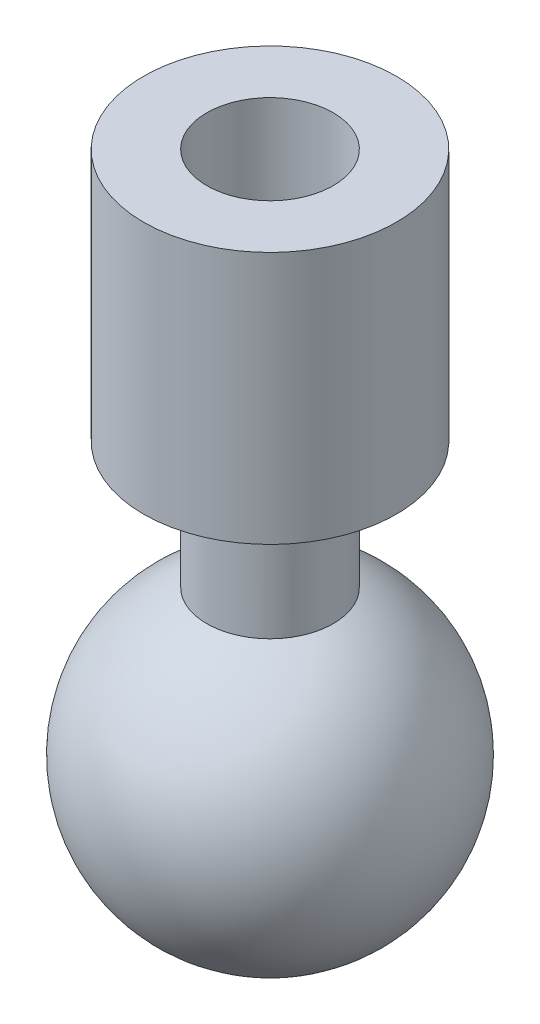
ISO-10303-21;
HEADER;
FILE_DESCRIPTION(('STEP AP214'),'2;1');
FILE_NAME('part.step','',(''),(''),'','','');
FILE_SCHEMA(('AUTOMOTIVE_DESIGN { 1 0 10303 214 1 1 1 1 }'));
ENDSEC;
DATA;
#1=APPLICATION_CONTEXT('core data for automotive mechanical design processes');
#2=APPLICATION_PROTOCOL_DEFINITION('international standard','automotive_design',2000,#1);
#3=PRODUCT_CONTEXT('',#1,'mechanical');
#4=PRODUCT('Part','Part','',(#3));
#5=PRODUCT_RELATED_PRODUCT_CATEGORY('part','',(#4));
#6=PRODUCT_DEFINITION_FORMATION('','',#4);
#7=PRODUCT_DEFINITION_CONTEXT('part definition',#1,'design');
#8=PRODUCT_DEFINITION('design','',#6,#7);
#9=PRODUCT_DEFINITION_SHAPE('','',#8);
#10=(LENGTH_UNIT() NAMED_UNIT(*) SI_UNIT(.MILLI.,.METRE.));
#11=(NAMED_UNIT(*) PLANE_ANGLE_UNIT() SI_UNIT($,.RADIAN.));
#12=(NAMED_UNIT(*) SI_UNIT($,.STERADIAN.) SOLID_ANGLE_UNIT());
#13=UNCERTAINTY_MEASURE_WITH_UNIT(LENGTH_MEASURE(1.E-05),#10,'distance_accuracy_value','');
#14=(GEOMETRIC_REPRESENTATION_CONTEXT(3) GLOBAL_UNCERTAINTY_ASSIGNED_CONTEXT((#13)) GLOBAL_UNIT_ASSIGNED_CONTEXT((#10,
#11,#12)) REPRESENTATION_CONTEXT('',''));
#15=CARTESIAN_POINT('',(0.,0.,0.));
#16=DIRECTION('',(0.,0.,1.));
#17=DIRECTION('',(1.,0.,0.));
#18=AXIS2_PLACEMENT_3D('',#15,#16,#17);
#19=CARTESIAN_POINT('',(0.,2.5,0.));
#20=DIRECTION('',(0.,-1.,0.));
#21=DIRECTION('',(-1.,0.,0.));
#22=AXIS2_PLACEMENT_3D('',#19,#20,#21);
#23=SPHERICAL_SURFACE('',#22,2.5);
#24=CARTESIAN_POINT('',(0.,4.79128784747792,0.));
#25=DIRECTION('',(0.,-1.,0.));
#26=DIRECTION('',(0.,0.,-1.));
#27=AXIS2_PLACEMENT_3D('',#24,#25,#26);
#28=CIRCLE('',#27,1.);
#29=CARTESIAN_POINT('',(0.,4.79128784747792,-1.));
#30=VERTEX_POINT('',#29);
#31=EDGE_CURVE('E10',#30,#30,#28,.T.);
#32=ORIENTED_EDGE('',*,*,#31,.T.);
#33=EDGE_LOOP('',(#32));
#34=FACE_BOUND('',#33,.T.);
#35=ADVANCED_FACE('F37',(#34),#23,.T.);
#36=CARTESIAN_POINT('',(0.,0.,0.));
#37=DIRECTION('',(0.,-1.,0.));
#38=DIRECTION('',(0.,0.,-1.));
#39=AXIS2_PLACEMENT_3D('',#36,#37,#38);
#40=CYLINDRICAL_SURFACE('',#39,1.);
#41=CARTESIAN_POINT('',(0.,6.79128784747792,0.));
#42=DIRECTION('',(0.,-1.,0.));
#43=DIRECTION('',(0.,0.,-1.));
#44=AXIS2_PLACEMENT_3D('',#41,#42,#43);
#45=CIRCLE('',#44,1.);
#46=CARTESIAN_POINT('',(0.,6.79128784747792,-1.));
#47=VERTEX_POINT('',#46);
#48=EDGE_CURVE('E44',#47,#47,#45,.T.);
#49=ORIENTED_EDGE('',*,*,#48,.T.);
#50=EDGE_LOOP('',(#49));
#51=FACE_BOUND('',#50,.T.);
#52=ORIENTED_EDGE('',*,*,#31,.F.);
#53=EDGE_LOOP('',(#52));
#54=FACE_BOUND('',#53,.T.);
#55=ADVANCED_FACE('F81',(#51,#54),#40,.T.);
#56=CARTESIAN_POINT('',(1.,6.79128784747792,0.));
#57=DIRECTION('',(0.,-1.,0.));
#58=DIRECTION('',(0.,0.,-1.));
#59=AXIS2_PLACEMENT_3D('',#56,#57,#58);
#60=PLANE('',#59);
#61=CARTESIAN_POINT('',(0.,6.79128784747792,0.));
#62=DIRECTION('',(0.,-1.,0.));
#63=DIRECTION('',(0.,0.,-1.));
#64=AXIS2_PLACEMENT_3D('',#61,#62,#63);
#65=CIRCLE('',#64,2.);
#66=CARTESIAN_POINT('',(0.,6.79128784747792,-2.));
#67=VERTEX_POINT('',#66);
#68=EDGE_CURVE('E49',#67,#67,#65,.T.);
#69=ORIENTED_EDGE('',*,*,#68,.T.);
#70=EDGE_LOOP('',(#69));
#71=FACE_BOUND('',#70,.T.);
#72=ORIENTED_EDGE('',*,*,#48,.F.);
#73=EDGE_LOOP('',(#72));
#74=FACE_BOUND('',#73,.T.);
#75=ADVANCED_FACE('F85',(#71,#74),#60,.T.);
#76=CARTESIAN_POINT('',(0.,0.,0.));
#77=DIRECTION('',(0.,-1.,0.));
#78=DIRECTION('',(0.,0.,-1.));
#79=AXIS2_PLACEMENT_3D('',#76,#77,#78);
#80=CYLINDRICAL_SURFACE('',#79,2.);
#81=CARTESIAN_POINT('',(0.,10.7912878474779,0.));
#82=DIRECTION('',(0.,-1.,0.));
#83=DIRECTION('',(0.,0.,-1.));
#84=AXIS2_PLACEMENT_3D('',#81,#82,#83);
#85=CIRCLE('',#84,2.);
#86=CARTESIAN_POINT('',(0.,10.7912878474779,-2.));
#87=VERTEX_POINT('',#86);
#88=EDGE_CURVE('E54',#87,#87,#85,.T.);
#89=ORIENTED_EDGE('',*,*,#88,.T.);
#90=EDGE_LOOP('',(#89));
#91=FACE_BOUND('',#90,.T.);
#92=ORIENTED_EDGE('',*,*,#68,.F.);
#93=EDGE_LOOP('',(#92));
#94=FACE_BOUND('',#93,.T.);
#95=ADVANCED_FACE('F89',(#91,#94),#80,.T.);
#96=CARTESIAN_POINT('',(2.,10.7912878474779,0.));
#97=DIRECTION('',(0.,1.,0.));
#98=DIRECTION('',(0.,0.,1.));
#99=AXIS2_PLACEMENT_3D('',#96,#97,#98);
#100=PLANE('',#99);
#101=CARTESIAN_POINT('',(0.,10.7912878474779,0.));
#102=DIRECTION('',(0.,-1.,0.));
#103=DIRECTION('',(0.,0.,-1.));
#104=AXIS2_PLACEMENT_3D('',#101,#102,#103);
#105=CIRCLE('',#104,1.);
#106=CARTESIAN_POINT('',(0.,10.7912878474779,-1.));
#107=VERTEX_POINT('',#106);
#108=EDGE_CURVE('E60',#107,#107,#105,.T.);
#109=ORIENTED_EDGE('',*,*,#108,.T.);
#110=EDGE_LOOP('',(#109));
#111=FACE_BOUND('',#110,.T.);
#112=ORIENTED_EDGE('',*,*,#88,.F.);
#113=EDGE_LOOP('',(#112));
#114=FACE_BOUND('',#113,.T.);
#115=ADVANCED_FACE('F78',(#111,#114),#100,.T.);
#116=CARTESIAN_POINT('',(0.,0.,0.));
#117=DIRECTION('',(0.,-1.,0.));
#118=DIRECTION('',(0.,0.,-1.));
#119=AXIS2_PLACEMENT_3D('',#116,#117,#118);
#120=CYLINDRICAL_SURFACE('',#119,1.);
#121=CARTESIAN_POINT('',(0.,7.79128784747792,0.));
#122=DIRECTION('',(0.,-1.,0.));
#123=DIRECTION('',(0.,0.,-1.));
#124=AXIS2_PLACEMENT_3D('',#121,#122,#123);
#125=CIRCLE('',#124,1.);
#126=CARTESIAN_POINT('',(0.,7.79128784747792,-1.));
#127=VERTEX_POINT('',#126);
#128=EDGE_CURVE('E64',#127,#127,#125,.T.);
#129=ORIENTED_EDGE('',*,*,#128,.T.);
#130=EDGE_LOOP('',(#129));
#131=FACE_BOUND('',#130,.T.);
#132=ORIENTED_EDGE('',*,*,#108,.F.);
#133=EDGE_LOOP('',(#132));
#134=FACE_BOUND('',#133,.T.);
#135=ADVANCED_FACE('F69',(#131,#134),#120,.F.);
#136=CARTESIAN_POINT('',(0.,7.79128784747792,0.));
#137=DIRECTION('',(0.,1.,0.));
#138=DIRECTION('',(0.,0.,1.));
#139=AXIS2_PLACEMENT_3D('',#136,#137,#138);
#140=PLANE('',#139);
#141=ORIENTED_EDGE('',*,*,#128,.F.);
#142=EDGE_LOOP('',(#141));
#143=FACE_BOUND('',#142,.T.);
#144=ADVANCED_FACE('F72',(#143),#140,.T.);
#145=CLOSED_SHELL('',(#35,#55,#75,#95,#115,#135,#144));
#146=MANIFOLD_SOLID_BREP('B2',#145);
#147=ADVANCED_BREP_SHAPE_REPRESENTATION('',(#18,#146),#14);
#148=SHAPE_DEFINITION_REPRESENTATION(#9,#147);
ENDSEC;
END-ISO-10303-21;
